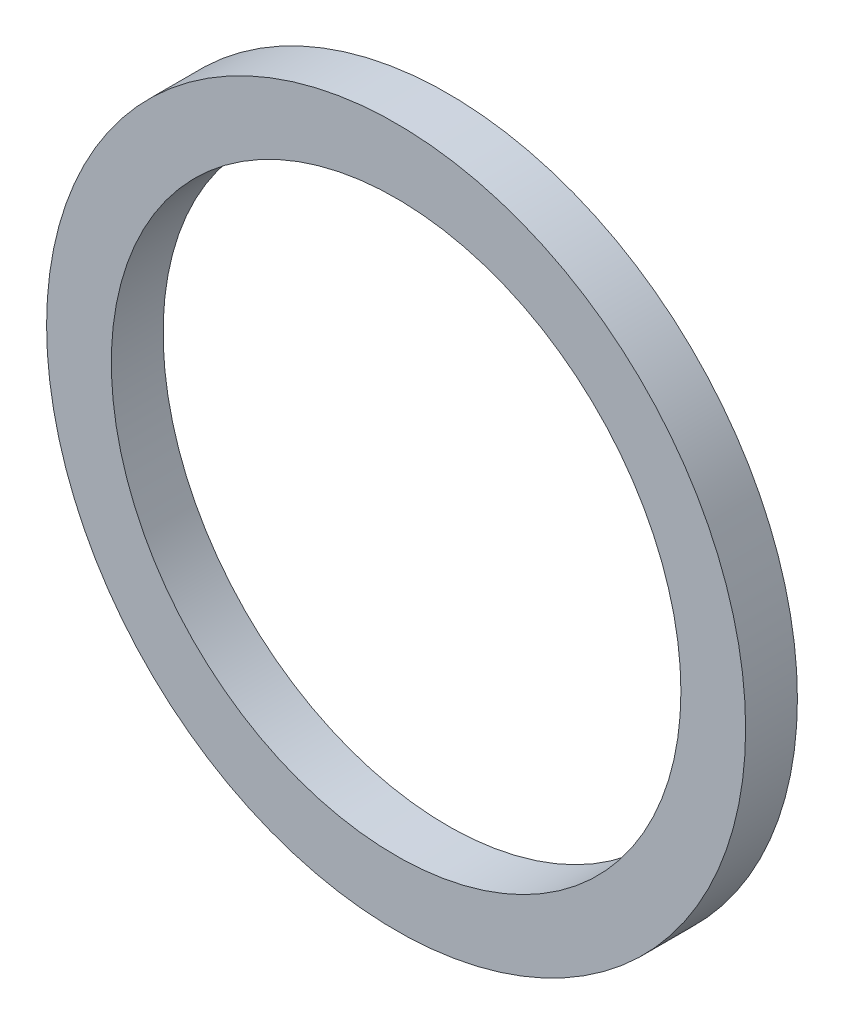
from build123d import *

# Parameters (mm, degrees)
ESQUISSE1_W = 2
ESQUISSE1_H = 2.5


with BuildPart() as part:
    # Esquisse1 → Base-R_volution (revolve)
    with BuildSketch(Plane(origin=(0, 0, 0), x_dir=(0, 0, -1), z_dir=(1, 0, 0)), mode=Mode.PRIVATE) as base_r_volution_sk:
        with Locations((1, 12.25)):
            Rectangle(ESQUISSE1_W, ESQUISSE1_H)
    revolve(base_r_volution_sk.sketch.rotate(Axis((0, 0, 0), (0, 0, -1)), 90), axis=Axis((0, 0, 0), (0, 0, -1)))


solid = part.part
